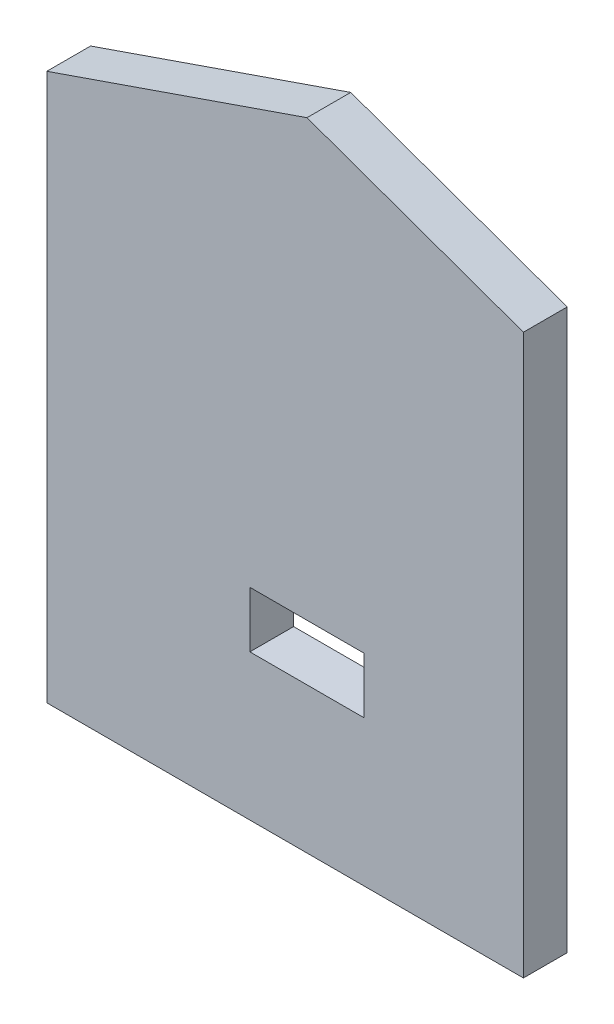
from build123d import *

# Parameters (mm, degrees)
ESQUISSE1_W        = 47
ESQUISSE1_H        = 23
BOSS_EXTRU_1_DEPTH = 18


with BuildPart() as part:
    # Esquisse1 → Boss.-Extru.1 (new body)
    with BuildSketch(Plane.XY):
        Polygon((0, 0), (196, 0), (196, 230), (107, 261.904651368), (0, 224.93), align=None)
        with Locations((107, 71.404651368)):
            Rectangle(ESQUISSE1_W, ESQUISSE1_H, mode=Mode.SUBTRACT)
    extrude(amount=BOSS_EXTRU_1_DEPTH)


solid = part.part
